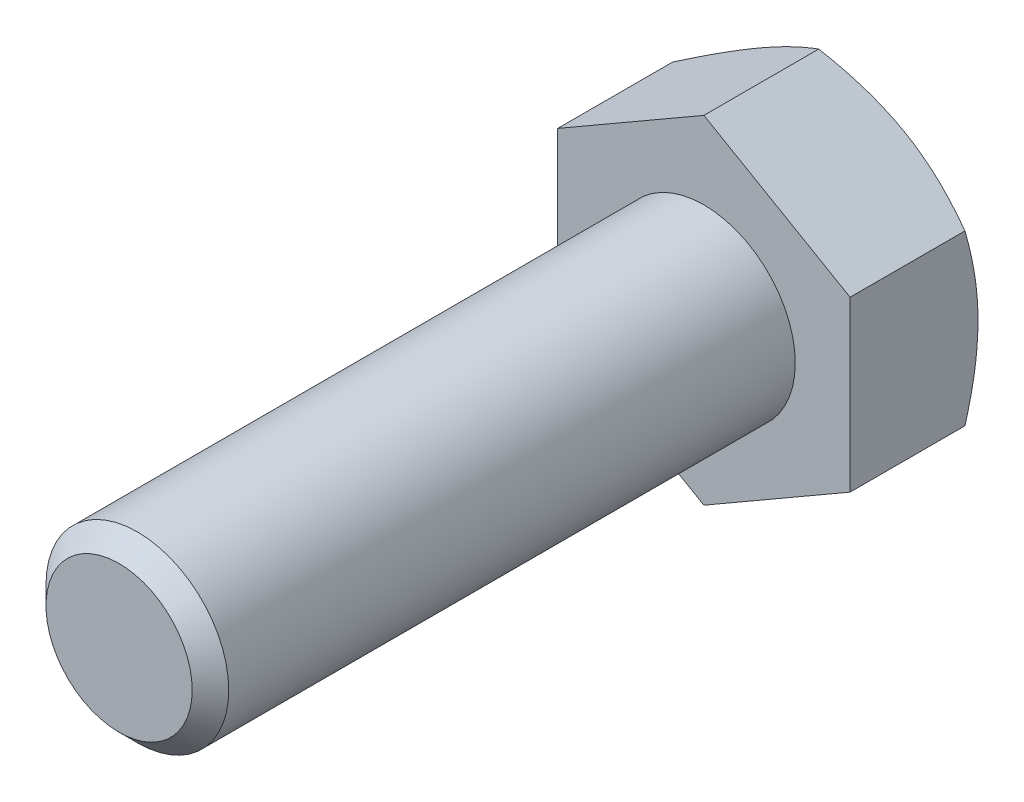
from build123d import *

# Parameters (mm, degrees)
ESQUISSE1_W        = 2.5
ESQUISSE1_H        = 16
CHANFREIN1_SIZE    = 0.5
BOSS_EXTRU_1_DEPTH = 3.5


with BuildPart() as part:
    # Esquisse1 → Base-R_volution (revolve)
    with BuildSketch(Plane(origin=(0, 0, 0), x_dir=(1, 0, 0), z_dir=(0, 1, 0))):
        with Locations((1.25, -8)):
            Rectangle(ESQUISSE1_W, ESQUISSE1_H)
    revolve(axis=Axis((0, 0, 0), (0, 0, 1)))

    # Chanfrein1
    chanfrein1_edges = [part.edges().sort_by_distance(p)[0] for p in [
        (-2.5, 0, 16),
    ]]
    chamfer(chanfrein1_edges, length=CHANFREIN1_SIZE)

    # Esquisse6 → Boss.-Extru.1 (add)
    with BuildSketch(Plane.XY):
        Polygon((4, -2.309401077), (4, 2.309401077), (0, 4.618802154), (-4, 2.309401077), (-4, -2.309401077), (0, -4.618802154), align=None)
    extrude(amount=-BOSS_EXTRU_1_DEPTH)

    # Esquisse7 → Enl_vement de mati_re-R_volution1 (revolve, cut)
    with BuildSketch(Plane(origin=(0, 0, 0), x_dir=(1, 0, 0), z_dir=(0, 1, 0))):
        Polygon((-4, 3.5), (-10.062177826, 3.5), (-10.062177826, 0), align=None)
    revolve(axis=Axis((0, 0, -6.239446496), (0, 0, 1)), mode=Mode.SUBTRACT)


solid = part.part
